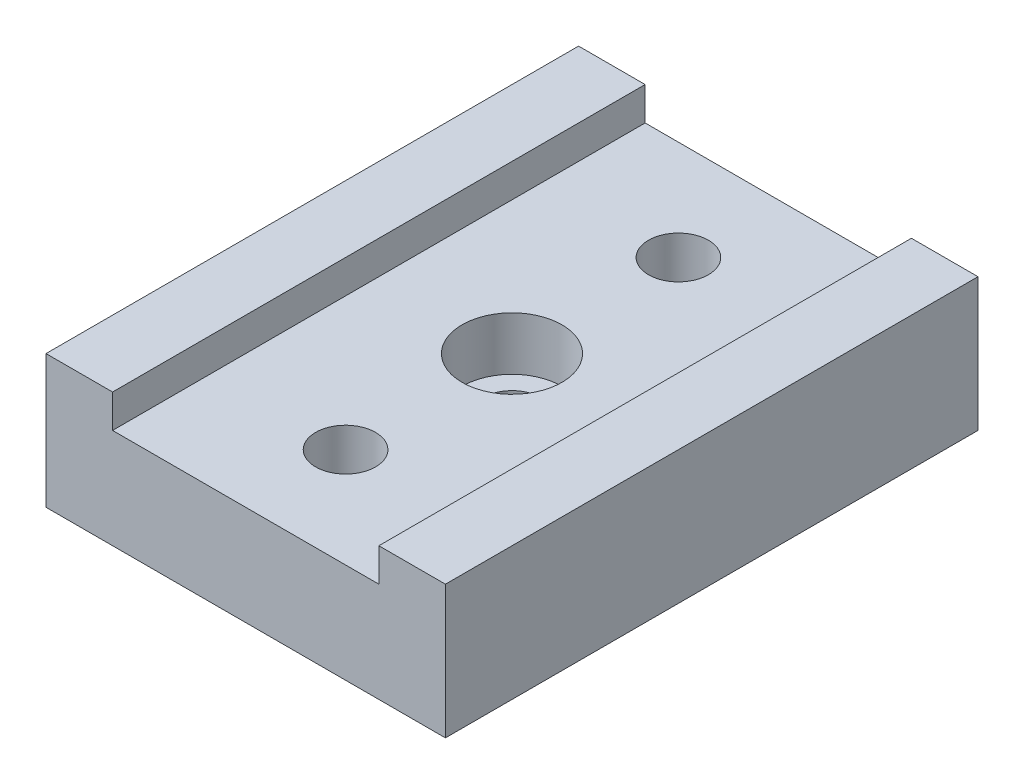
ISO-10303-21;
HEADER;
FILE_DESCRIPTION(('STEP AP214'),'2;1');
FILE_NAME('part.step','',(''),(''),'','','');
FILE_SCHEMA(('AUTOMOTIVE_DESIGN { 1 0 10303 214 1 1 1 1 }'));
ENDSEC;
DATA;
#1=APPLICATION_CONTEXT('core data for automotive mechanical design processes');
#2=APPLICATION_PROTOCOL_DEFINITION('international standard','automotive_design',2000,#1);
#3=PRODUCT_CONTEXT('',#1,'mechanical');
#4=PRODUCT('Part','Part','',(#3));
#5=PRODUCT_RELATED_PRODUCT_CATEGORY('part','',(#4));
#6=PRODUCT_DEFINITION_FORMATION('','',#4);
#7=PRODUCT_DEFINITION_CONTEXT('part definition',#1,'design');
#8=PRODUCT_DEFINITION('design','',#6,#7);
#9=PRODUCT_DEFINITION_SHAPE('','',#8);
#10=(LENGTH_UNIT() NAMED_UNIT(*) SI_UNIT(.MILLI.,.METRE.));
#11=(NAMED_UNIT(*) PLANE_ANGLE_UNIT() SI_UNIT($,.RADIAN.));
#12=(NAMED_UNIT(*) SI_UNIT($,.STERADIAN.) SOLID_ANGLE_UNIT());
#13=UNCERTAINTY_MEASURE_WITH_UNIT(LENGTH_MEASURE(1.E-05),#10,'distance_accuracy_value','');
#14=(GEOMETRIC_REPRESENTATION_CONTEXT(3) GLOBAL_UNCERTAINTY_ASSIGNED_CONTEXT((#13)) GLOBAL_UNIT_ASSIGNED_CONTEXT((#10,
#11,#12)) REPRESENTATION_CONTEXT('',''));
#15=CARTESIAN_POINT('',(0.,0.,0.));
#16=DIRECTION('',(0.,0.,1.));
#17=DIRECTION('',(1.,0.,0.));
#18=AXIS2_PLACEMENT_3D('',#15,#16,#17);
#19=CARTESIAN_POINT('',(30.,15.,40.));
#20=DIRECTION('',(0.,1.,0.));
#21=DIRECTION('',(0.,0.,1.));
#22=AXIS2_PLACEMENT_3D('',#19,#20,#21);
#23=CYLINDRICAL_SURFACE('',#22,4.5);
#24=CARTESIAN_POINT('',(30.,6.99999999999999,40.));
#25=DIRECTION('',(0.,1.,0.));
#26=DIRECTION('',(0.,0.,1.));
#27=AXIS2_PLACEMENT_3D('',#24,#25,#26);
#28=CIRCLE('',#27,4.5);
#29=CARTESIAN_POINT('',(30.,6.99999999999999,44.5));
#30=VERTEX_POINT('',#29);
#31=EDGE_CURVE('E135',#30,#30,#28,.T.);
#32=ORIENTED_EDGE('',*,*,#31,.T.);
#33=EDGE_LOOP('',(#32));
#34=FACE_BOUND('',#33,.T.);
#35=CARTESIAN_POINT('',(30.,2.,40.));
#36=DIRECTION('',(0.,-1.,0.));
#37=DIRECTION('',(1.,0.,0.));
#38=AXIS2_PLACEMENT_3D('',#35,#36,#37);
#39=CIRCLE('',#38,4.5);
#40=CARTESIAN_POINT('',(34.5,2.,40.));
#41=VERTEX_POINT('',#40);
#42=EDGE_CURVE('E158',#41,#41,#39,.F.);
#43=ORIENTED_EDGE('',*,*,#42,.F.);
#44=EDGE_LOOP('',(#43));
#45=FACE_BOUND('',#44,.T.);
#46=ADVANCED_FACE('F32',(#34,#45),#23,.F.);
#47=CARTESIAN_POINT('',(60.,0.,80.));
#48=DIRECTION('',(0.,1.,0.));
#49=DIRECTION('',(-1.,0.,0.));
#50=AXIS2_PLACEMENT_3D('',#47,#48,#49);
#51=PLANE('',#50);
#52=CARTESIAN_POINT('',(30.,0.,15.));
#53=DIRECTION('',(0.,-1.,0.));
#54=DIRECTION('',(0.,0.,-1.));
#55=AXIS2_PLACEMENT_3D('',#52,#53,#54);
#56=CIRCLE('',#55,7.5);
#57=CARTESIAN_POINT('',(30.,0.,7.5));
#58=VERTEX_POINT('',#57);
#59=EDGE_CURVE('E407',#58,#58,#56,.T.);
#60=ORIENTED_EDGE('',*,*,#59,.F.);
#61=EDGE_LOOP('',(#60));
#62=FACE_BOUND('',#61,.T.);
#63=CARTESIAN_POINT('',(30.,0.,65.));
#64=DIRECTION('',(0.,-1.,0.));
#65=DIRECTION('',(0.,0.,-1.));
#66=AXIS2_PLACEMENT_3D('',#63,#64,#65);
#67=CIRCLE('',#66,7.5);
#68=CARTESIAN_POINT('',(30.,0.,57.5));
#69=VERTEX_POINT('',#68);
#70=EDGE_CURVE('E176',#69,#69,#67,.T.);
#71=ORIENTED_EDGE('',*,*,#70,.F.);
#72=EDGE_LOOP('',(#71));
#73=FACE_BOUND('',#72,.T.);
#74=CARTESIAN_POINT('',(30.,0.,40.));
#75=DIRECTION('',(0.,-1.,0.));
#76=DIRECTION('',(1.,0.,0.));
#77=AXIS2_PLACEMENT_3D('',#74,#75,#76);
#78=CIRCLE('',#77,9.99999999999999);
#79=CARTESIAN_POINT('',(40.,0.,40.));
#80=VERTEX_POINT('',#79);
#81=EDGE_CURVE('E164',#80,#80,#78,.T.);
#82=ORIENTED_EDGE('',*,*,#81,.F.);
#83=EDGE_LOOP('',(#82));
#84=FACE_BOUND('',#83,.T.);
#85=DIRECTION('',(1.,0.,0.));
#86=VECTOR('',#85,1.);
#87=CARTESIAN_POINT('',(60.,0.,0.));
#88=LINE('',#87,#86);
#89=CARTESIAN_POINT('',(0.,0.,0.));
#90=VERTEX_POINT('',#89);
#91=CARTESIAN_POINT('',(60.,0.,0.));
#92=VERTEX_POINT('',#91);
#93=EDGE_CURVE('E131',#90,#92,#88,.T.);
#94=ORIENTED_EDGE('',*,*,#93,.T.);
#95=DIRECTION('',(0.,0.,-1.));
#96=VECTOR('',#95,1.);
#97=CARTESIAN_POINT('',(60.,0.,80.));
#98=LINE('',#97,#96);
#99=CARTESIAN_POINT('',(60.,0.,80.));
#100=VERTEX_POINT('',#99);
#101=EDGE_CURVE('E11',#100,#92,#98,.T.);
#102=ORIENTED_EDGE('',*,*,#101,.F.);
#103=DIRECTION('',(1.,0.,0.));
#104=VECTOR('',#103,1.);
#105=CARTESIAN_POINT('',(60.,0.,80.));
#106=LINE('',#105,#104);
#107=CARTESIAN_POINT('',(0.,0.,80.));
#108=VERTEX_POINT('',#107);
#109=EDGE_CURVE('E146',#108,#100,#106,.T.);
#110=ORIENTED_EDGE('',*,*,#109,.F.);
#111=DIRECTION('',(0.,0.,-1.));
#112=VECTOR('',#111,1.);
#113=CARTESIAN_POINT('',(0.,0.,80.));
#114=LINE('',#113,#112);
#115=EDGE_CURVE('E127',#108,#90,#114,.T.);
#116=ORIENTED_EDGE('',*,*,#115,.T.);
#117=EDGE_LOOP('',(#94,#102,#110,#116));
#118=FACE_BOUND('',#117,.T.);
#119=ADVANCED_FACE('F34',(#62,#73,#84,#118),#51,.F.);
#120=CARTESIAN_POINT('',(60.,0.,80.));
#121=DIRECTION('',(-1.,0.,0.));
#122=DIRECTION('',(0.,0.,1.));
#123=AXIS2_PLACEMENT_3D('',#120,#121,#122);
#124=PLANE('',#123);
#125=DIRECTION('',(0.,1.,0.));
#126=VECTOR('',#125,1.);
#127=CARTESIAN_POINT('',(60.,0.,0.));
#128=LINE('',#127,#126);
#129=CARTESIAN_POINT('',(60.,20.,0.));
#130=VERTEX_POINT('',#129);
#131=EDGE_CURVE('E134',#92,#130,#128,.T.);
#132=ORIENTED_EDGE('',*,*,#131,.T.);
#133=DIRECTION('',(0.,0.,-1.));
#134=VECTOR('',#133,1.);
#135=CARTESIAN_POINT('',(60.,20.,80.));
#136=LINE('',#135,#134);
#137=CARTESIAN_POINT('',(60.,20.,80.));
#138=VERTEX_POINT('',#137);
#139=EDGE_CURVE('E42',#138,#130,#136,.T.);
#140=ORIENTED_EDGE('',*,*,#139,.F.);
#141=DIRECTION('',(0.,1.,0.));
#142=VECTOR('',#141,1.);
#143=CARTESIAN_POINT('',(60.,0.,80.));
#144=LINE('',#143,#142);
#145=EDGE_CURVE('E94',#100,#138,#144,.T.);
#146=ORIENTED_EDGE('',*,*,#145,.F.);
#147=ORIENTED_EDGE('',*,*,#101,.T.);
#148=EDGE_LOOP('',(#132,#140,#146,#147));
#149=FACE_BOUND('',#148,.T.);
#150=ADVANCED_FACE('F228',(#149),#124,.F.);
#151=CARTESIAN_POINT('',(50.,20.,80.));
#152=DIRECTION('',(0.,-1.,0.));
#153=DIRECTION('',(0.,0.,-1.));
#154=AXIS2_PLACEMENT_3D('',#151,#152,#153);
#155=PLANE('',#154);
#156=DIRECTION('',(-1.,0.,0.));
#157=VECTOR('',#156,1.);
#158=CARTESIAN_POINT('',(50.,20.,0.));
#159=LINE('',#158,#157);
#160=CARTESIAN_POINT('',(50.,20.,0.));
#161=VERTEX_POINT('',#160);
#162=EDGE_CURVE('E137',#130,#161,#159,.T.);
#163=ORIENTED_EDGE('',*,*,#162,.T.);
#164=DIRECTION('',(0.,0.,-1.));
#165=VECTOR('',#164,1.);
#166=CARTESIAN_POINT('',(50.,20.,80.));
#167=LINE('',#166,#165);
#168=CARTESIAN_POINT('',(50.,20.,80.));
#169=VERTEX_POINT('',#168);
#170=EDGE_CURVE('E153',#169,#161,#167,.T.);
#171=ORIENTED_EDGE('',*,*,#170,.F.);
#172=DIRECTION('',(-1.,0.,0.));
#173=VECTOR('',#172,1.);
#174=CARTESIAN_POINT('',(50.,20.,80.));
#175=LINE('',#174,#173);
#176=EDGE_CURVE('E191',#138,#169,#175,.T.);
#177=ORIENTED_EDGE('',*,*,#176,.F.);
#178=ORIENTED_EDGE('',*,*,#139,.T.);
#179=EDGE_LOOP('',(#163,#171,#177,#178));
#180=FACE_BOUND('',#179,.T.);
#181=ADVANCED_FACE('F260',(#180),#155,.F.);
#182=CARTESIAN_POINT('',(50.,15.,80.));
#183=DIRECTION('',(1.,0.,0.));
#184=DIRECTION('',(0.,0.,-1.));
#185=AXIS2_PLACEMENT_3D('',#182,#183,#184);
#186=PLANE('',#185);
#187=DIRECTION('',(0.,-1.,0.));
#188=VECTOR('',#187,1.);
#189=CARTESIAN_POINT('',(50.,15.,0.));
#190=LINE('',#189,#188);
#191=CARTESIAN_POINT('',(50.,15.,0.));
#192=VERTEX_POINT('',#191);
#193=EDGE_CURVE('E139',#161,#192,#190,.T.);
#194=ORIENTED_EDGE('',*,*,#193,.T.);
#195=DIRECTION('',(0.,0.,-1.));
#196=VECTOR('',#195,1.);
#197=CARTESIAN_POINT('',(50.,15.,80.));
#198=LINE('',#197,#196);
#199=CARTESIAN_POINT('',(50.,15.,80.));
#200=VERTEX_POINT('',#199);
#201=EDGE_CURVE('E150',#200,#192,#198,.T.);
#202=ORIENTED_EDGE('',*,*,#201,.F.);
#203=DIRECTION('',(0.,-1.,0.));
#204=VECTOR('',#203,1.);
#205=CARTESIAN_POINT('',(50.,15.,80.));
#206=LINE('',#205,#204);
#207=EDGE_CURVE('E193',#169,#200,#206,.T.);
#208=ORIENTED_EDGE('',*,*,#207,.F.);
#209=ORIENTED_EDGE('',*,*,#170,.T.);
#210=EDGE_LOOP('',(#194,#202,#208,#209));
#211=FACE_BOUND('',#210,.T.);
#212=ADVANCED_FACE('F199',(#211),#186,.F.);
#213=CARTESIAN_POINT('',(10.,15.,80.));
#214=DIRECTION('',(0.,-1.,0.));
#215=DIRECTION('',(0.,0.,-1.));
#216=AXIS2_PLACEMENT_3D('',#213,#214,#215);
#217=PLANE('',#216);
#218=CARTESIAN_POINT('',(30.,15.,15.));
#219=DIRECTION('',(0.,-1.,0.));
#220=DIRECTION('',(0.,0.,-1.));
#221=AXIS2_PLACEMENT_3D('',#218,#219,#220);
#222=CIRCLE('',#221,4.5);
#223=CARTESIAN_POINT('',(30.,15.,10.5));
#224=VERTEX_POINT('',#223);
#225=EDGE_CURVE('E36',#224,#224,#222,.T.);
#226=ORIENTED_EDGE('',*,*,#225,.T.);
#227=EDGE_LOOP('',(#226));
#228=FACE_BOUND('',#227,.T.);
#229=CARTESIAN_POINT('',(30.,15.,65.));
#230=DIRECTION('',(0.,-1.,0.));
#231=DIRECTION('',(0.,0.,-1.));
#232=AXIS2_PLACEMENT_3D('',#229,#230,#231);
#233=CIRCLE('',#232,4.5);
#234=CARTESIAN_POINT('',(30.,15.,60.5));
#235=VERTEX_POINT('',#234);
#236=EDGE_CURVE('E162',#235,#235,#233,.T.);
#237=ORIENTED_EDGE('',*,*,#236,.T.);
#238=EDGE_LOOP('',(#237));
#239=FACE_BOUND('',#238,.T.);
#240=CARTESIAN_POINT('',(30.,15.,40.));
#241=DIRECTION('',(0.,1.,0.));
#242=DIRECTION('',(0.,0.,1.));
#243=AXIS2_PLACEMENT_3D('',#240,#241,#242);
#244=CIRCLE('',#243,7.5);
#245=CARTESIAN_POINT('',(30.,15.,47.5));
#246=VERTEX_POINT('',#245);
#247=EDGE_CURVE('E160',#246,#246,#244,.T.);
#248=ORIENTED_EDGE('',*,*,#247,.F.);
#249=EDGE_LOOP('',(#248));
#250=FACE_BOUND('',#249,.T.);
#251=DIRECTION('',(-1.,0.,0.));
#252=VECTOR('',#251,1.);
#253=CARTESIAN_POINT('',(10.,15.,0.));
#254=LINE('',#253,#252);
#255=CARTESIAN_POINT('',(10.,15.,0.));
#256=VERTEX_POINT('',#255);
#257=EDGE_CURVE('E141',#192,#256,#254,.T.);
#258=ORIENTED_EDGE('',*,*,#257,.T.);
#259=DIRECTION('',(0.,0.,-1.));
#260=VECTOR('',#259,1.);
#261=CARTESIAN_POINT('',(10.,15.,80.));
#262=LINE('',#261,#260);
#263=CARTESIAN_POINT('',(10.,15.,80.));
#264=VERTEX_POINT('',#263);
#265=EDGE_CURVE('E122',#264,#256,#262,.T.);
#266=ORIENTED_EDGE('',*,*,#265,.F.);
#267=DIRECTION('',(-1.,0.,0.));
#268=VECTOR('',#267,1.);
#269=CARTESIAN_POINT('',(10.,15.,80.));
#270=LINE('',#269,#268);
#271=EDGE_CURVE('E113',#200,#264,#270,.T.);
#272=ORIENTED_EDGE('',*,*,#271,.F.);
#273=ORIENTED_EDGE('',*,*,#201,.T.);
#274=EDGE_LOOP('',(#258,#266,#272,#273));
#275=FACE_BOUND('',#274,.T.);
#276=ADVANCED_FACE('F203',(#228,#239,#250,#275),#217,.F.);
#277=CARTESIAN_POINT('',(10.,20.,80.));
#278=DIRECTION('',(-1.,0.,0.));
#279=DIRECTION('',(0.,-1.,0.));
#280=AXIS2_PLACEMENT_3D('',#277,#278,#279);
#281=PLANE('',#280);
#282=DIRECTION('',(0.,1.,0.));
#283=VECTOR('',#282,1.);
#284=CARTESIAN_POINT('',(10.,20.,0.));
#285=LINE('',#284,#283);
#286=CARTESIAN_POINT('',(10.,20.,0.));
#287=VERTEX_POINT('',#286);
#288=EDGE_CURVE('E121',#256,#287,#285,.T.);
#289=ORIENTED_EDGE('',*,*,#288,.T.);
#290=DIRECTION('',(0.,0.,-1.));
#291=VECTOR('',#290,1.);
#292=CARTESIAN_POINT('',(10.,20.,80.));
#293=LINE('',#292,#291);
#294=CARTESIAN_POINT('',(10.,20.,80.));
#295=VERTEX_POINT('',#294);
#296=EDGE_CURVE('E118',#295,#287,#293,.T.);
#297=ORIENTED_EDGE('',*,*,#296,.F.);
#298=DIRECTION('',(0.,1.,0.));
#299=VECTOR('',#298,1.);
#300=CARTESIAN_POINT('',(10.,20.,80.));
#301=LINE('',#300,#299);
#302=EDGE_CURVE('E107',#264,#295,#301,.T.);
#303=ORIENTED_EDGE('',*,*,#302,.F.);
#304=ORIENTED_EDGE('',*,*,#265,.T.);
#305=EDGE_LOOP('',(#289,#297,#303,#304));
#306=FACE_BOUND('',#305,.T.);
#307=ADVANCED_FACE('F119',(#306),#281,.F.);
#308=CARTESIAN_POINT('',(0.,20.,80.));
#309=DIRECTION('',(0.,-1.,0.));
#310=DIRECTION('',(0.,0.,-1.));
#311=AXIS2_PLACEMENT_3D('',#308,#309,#310);
#312=PLANE('',#311);
#313=DIRECTION('',(-1.,0.,0.));
#314=VECTOR('',#313,1.);
#315=CARTESIAN_POINT('',(0.,20.,0.));
#316=LINE('',#315,#314);
#317=CARTESIAN_POINT('',(0.,20.,0.));
#318=VERTEX_POINT('',#317);
#319=EDGE_CURVE('E80',#287,#318,#316,.T.);
#320=ORIENTED_EDGE('',*,*,#319,.T.);
#321=DIRECTION('',(0.,0.,-1.));
#322=VECTOR('',#321,1.);
#323=CARTESIAN_POINT('',(0.,20.,80.));
#324=LINE('',#323,#322);
#325=CARTESIAN_POINT('',(0.,20.,80.));
#326=VERTEX_POINT('',#325);
#327=EDGE_CURVE('E123',#326,#318,#324,.T.);
#328=ORIENTED_EDGE('',*,*,#327,.F.);
#329=DIRECTION('',(-1.,0.,0.));
#330=VECTOR('',#329,1.);
#331=CARTESIAN_POINT('',(0.,20.,80.));
#332=LINE('',#331,#330);
#333=EDGE_CURVE('E111',#295,#326,#332,.T.);
#334=ORIENTED_EDGE('',*,*,#333,.F.);
#335=ORIENTED_EDGE('',*,*,#296,.T.);
#336=EDGE_LOOP('',(#320,#328,#334,#335));
#337=FACE_BOUND('',#336,.T.);
#338=ADVANCED_FACE('F125',(#337),#312,.F.);
#339=CARTESIAN_POINT('',(0.,0.,80.));
#340=DIRECTION('',(1.,0.,0.));
#341=DIRECTION('',(0.,0.,-1.));
#342=AXIS2_PLACEMENT_3D('',#339,#340,#341);
#343=PLANE('',#342);
#344=DIRECTION('',(0.,-1.,0.));
#345=VECTOR('',#344,1.);
#346=CARTESIAN_POINT('',(0.,0.,0.));
#347=LINE('',#346,#345);
#348=EDGE_CURVE('E86',#318,#90,#347,.T.);
#349=ORIENTED_EDGE('',*,*,#348,.T.);
#350=ORIENTED_EDGE('',*,*,#115,.F.);
#351=DIRECTION('',(0.,-1.,0.));
#352=VECTOR('',#351,1.);
#353=CARTESIAN_POINT('',(0.,0.,80.));
#354=LINE('',#353,#352);
#355=EDGE_CURVE('E51',#326,#108,#354,.T.);
#356=ORIENTED_EDGE('',*,*,#355,.F.);
#357=ORIENTED_EDGE('',*,*,#327,.T.);
#358=EDGE_LOOP('',(#349,#350,#356,#357));
#359=FACE_BOUND('',#358,.T.);
#360=ADVANCED_FACE('F211',(#359),#343,.F.);
#361=CARTESIAN_POINT('',(0.,0.,80.));
#362=DIRECTION('',(0.,0.,-1.));
#363=DIRECTION('',(-1.,0.,0.));
#364=AXIS2_PLACEMENT_3D('',#361,#362,#363);
#365=PLANE('',#364);
#366=ORIENTED_EDGE('',*,*,#109,.T.);
#367=ORIENTED_EDGE('',*,*,#145,.T.);
#368=ORIENTED_EDGE('',*,*,#176,.T.);
#369=ORIENTED_EDGE('',*,*,#207,.T.);
#370=ORIENTED_EDGE('',*,*,#271,.T.);
#371=ORIENTED_EDGE('',*,*,#302,.T.);
#372=ORIENTED_EDGE('',*,*,#333,.T.);
#373=ORIENTED_EDGE('',*,*,#355,.T.);
#374=EDGE_LOOP('',(#366,#367,#368,#369,#370,#371,#372,#373));
#375=FACE_BOUND('',#374,.T.);
#376=ADVANCED_FACE('F109',(#375),#365,.F.);
#377=CARTESIAN_POINT('',(0.,0.,0.));
#378=DIRECTION('',(0.,0.,-1.));
#379=DIRECTION('',(-1.,0.,0.));
#380=AXIS2_PLACEMENT_3D('',#377,#378,#379);
#381=PLANE('',#380);
#382=ORIENTED_EDGE('',*,*,#93,.F.);
#383=ORIENTED_EDGE('',*,*,#348,.F.);
#384=ORIENTED_EDGE('',*,*,#319,.F.);
#385=ORIENTED_EDGE('',*,*,#288,.F.);
#386=ORIENTED_EDGE('',*,*,#257,.F.);
#387=ORIENTED_EDGE('',*,*,#193,.F.);
#388=ORIENTED_EDGE('',*,*,#162,.F.);
#389=ORIENTED_EDGE('',*,*,#131,.F.);
#390=EDGE_LOOP('',(#382,#383,#384,#385,#386,#387,#388,#389));
#391=FACE_BOUND('',#390,.T.);
#392=ADVANCED_FACE('F206',(#391),#381,.T.);
#393=CARTESIAN_POINT('',(34.5,6.99999999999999,40.));
#394=DIRECTION('',(0.,-1.,0.));
#395=DIRECTION('',(0.,0.,-1.));
#396=AXIS2_PLACEMENT_3D('',#393,#394,#395);
#397=PLANE('',#396);
#398=ORIENTED_EDGE('',*,*,#31,.F.);
#399=EDGE_LOOP('',(#398));
#400=FACE_BOUND('',#399,.T.);
#401=CARTESIAN_POINT('',(30.,6.99999999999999,40.));
#402=DIRECTION('',(0.,1.,0.));
#403=DIRECTION('',(0.,0.,1.));
#404=AXIS2_PLACEMENT_3D('',#401,#402,#403);
#405=CIRCLE('',#404,7.5);
#406=CARTESIAN_POINT('',(30.,6.99999999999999,47.5));
#407=VERTEX_POINT('',#406);
#408=EDGE_CURVE('E184',#407,#407,#405,.T.);
#409=ORIENTED_EDGE('',*,*,#408,.T.);
#410=EDGE_LOOP('',(#409));
#411=FACE_BOUND('',#410,.T.);
#412=ADVANCED_FACE('F232',(#400,#411),#397,.F.);
#413=CARTESIAN_POINT('',(30.,15.,40.));
#414=DIRECTION('',(0.,1.,0.));
#415=DIRECTION('',(0.,0.,1.));
#416=AXIS2_PLACEMENT_3D('',#413,#414,#415);
#417=CYLINDRICAL_SURFACE('',#416,7.5);
#418=ORIENTED_EDGE('',*,*,#408,.F.);
#419=EDGE_LOOP('',(#418));
#420=FACE_BOUND('',#419,.T.);
#421=ORIENTED_EDGE('',*,*,#247,.T.);
#422=EDGE_LOOP('',(#421));
#423=FACE_BOUND('',#422,.T.);
#424=ADVANCED_FACE('F238',(#420,#423),#417,.F.);
#425=CARTESIAN_POINT('',(30.,2.,40.));
#426=DIRECTION('',(0.,-1.,0.));
#427=DIRECTION('',(1.,0.,0.));
#428=AXIS2_PLACEMENT_3D('',#425,#426,#427);
#429=PLANE('',#428);
#430=CARTESIAN_POINT('',(30.,2.,40.));
#431=DIRECTION('',(0.,-1.,0.));
#432=DIRECTION('',(1.,0.,0.));
#433=AXIS2_PLACEMENT_3D('',#430,#431,#432);
#434=CIRCLE('',#433,9.99999999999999);
#435=CARTESIAN_POINT('',(40.,2.,40.));
#436=VERTEX_POINT('',#435);
#437=EDGE_CURVE('E161',#436,#436,#434,.T.);
#438=ORIENTED_EDGE('',*,*,#437,.T.);
#439=EDGE_LOOP('',(#438));
#440=FACE_BOUND('',#439,.T.);
#441=ORIENTED_EDGE('',*,*,#42,.T.);
#442=EDGE_LOOP('',(#441));
#443=FACE_BOUND('',#442,.T.);
#444=ADVANCED_FACE('F243',(#440,#443),#429,.T.);
#445=CARTESIAN_POINT('',(30.,2.,40.));
#446=DIRECTION('',(0.,-1.,0.));
#447=DIRECTION('',(1.,0.,0.));
#448=AXIS2_PLACEMENT_3D('',#445,#446,#447);
#449=CYLINDRICAL_SURFACE('',#448,9.99999999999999);
#450=ORIENTED_EDGE('',*,*,#437,.F.);
#451=EDGE_LOOP('',(#450));
#452=FACE_BOUND('',#451,.T.);
#453=ORIENTED_EDGE('',*,*,#81,.T.);
#454=EDGE_LOOP('',(#453));
#455=FACE_BOUND('',#454,.T.);
#456=ADVANCED_FACE('F328',(#452,#455),#449,.F.);
#457=CARTESIAN_POINT('',(30.,0.,65.));
#458=DIRECTION('',(0.,-1.,0.));
#459=DIRECTION('',(0.,0.,-1.));
#460=AXIS2_PLACEMENT_3D('',#457,#458,#459);
#461=CYLINDRICAL_SURFACE('',#460,4.5);
#462=CARTESIAN_POINT('',(30.,8.,65.));
#463=DIRECTION('',(0.,-1.,0.));
#464=DIRECTION('',(0.,0.,-1.));
#465=AXIS2_PLACEMENT_3D('',#462,#463,#464);
#466=CIRCLE('',#465,4.5);
#467=CARTESIAN_POINT('',(30.,8.,60.5));
#468=VERTEX_POINT('',#467);
#469=EDGE_CURVE('E165',#468,#468,#466,.T.);
#470=ORIENTED_EDGE('',*,*,#469,.T.);
#471=EDGE_LOOP('',(#470));
#472=FACE_BOUND('',#471,.T.);
#473=ORIENTED_EDGE('',*,*,#236,.F.);
#474=EDGE_LOOP('',(#473));
#475=FACE_BOUND('',#474,.T.);
#476=ADVANCED_FACE('F337',(#472,#475),#461,.F.);
#477=CARTESIAN_POINT('',(34.5,8.,65.));
#478=DIRECTION('',(0.,1.,0.));
#479=DIRECTION('',(0.,0.,1.));
#480=AXIS2_PLACEMENT_3D('',#477,#478,#479);
#481=PLANE('',#480);
#482=ORIENTED_EDGE('',*,*,#469,.F.);
#483=EDGE_LOOP('',(#482));
#484=FACE_BOUND('',#483,.T.);
#485=CARTESIAN_POINT('',(30.,8.,65.));
#486=DIRECTION('',(0.,-1.,0.));
#487=DIRECTION('',(0.,0.,-1.));
#488=AXIS2_PLACEMENT_3D('',#485,#486,#487);
#489=CIRCLE('',#488,7.5);
#490=CARTESIAN_POINT('',(30.,8.,57.5));
#491=VERTEX_POINT('',#490);
#492=EDGE_CURVE('E171',#491,#491,#489,.T.);
#493=ORIENTED_EDGE('',*,*,#492,.T.);
#494=EDGE_LOOP('',(#493));
#495=FACE_BOUND('',#494,.T.);
#496=ADVANCED_FACE('F348',(#484,#495),#481,.F.);
#497=CARTESIAN_POINT('',(30.,0.,65.));
#498=DIRECTION('',(0.,-1.,0.));
#499=DIRECTION('',(0.,0.,-1.));
#500=AXIS2_PLACEMENT_3D('',#497,#498,#499);
#501=CYLINDRICAL_SURFACE('',#500,7.5);
#502=ORIENTED_EDGE('',*,*,#492,.F.);
#503=EDGE_LOOP('',(#502));
#504=FACE_BOUND('',#503,.T.);
#505=ORIENTED_EDGE('',*,*,#70,.T.);
#506=EDGE_LOOP('',(#505));
#507=FACE_BOUND('',#506,.T.);
#508=ADVANCED_FACE('F354',(#504,#507),#501,.F.);
#509=CARTESIAN_POINT('',(30.,0.,15.));
#510=DIRECTION('',(0.,-1.,0.));
#511=DIRECTION('',(0.,0.,-1.));
#512=AXIS2_PLACEMENT_3D('',#509,#510,#511);
#513=CYLINDRICAL_SURFACE('',#512,4.5);
#514=CARTESIAN_POINT('',(30.,8.,15.));
#515=DIRECTION('',(0.,-1.,0.));
#516=DIRECTION('',(0.,0.,-1.));
#517=AXIS2_PLACEMENT_3D('',#514,#515,#516);
#518=CIRCLE('',#517,4.5);
#519=CARTESIAN_POINT('',(30.,8.,10.5));
#520=VERTEX_POINT('',#519);
#521=EDGE_CURVE('E409',#520,#520,#518,.T.);
#522=ORIENTED_EDGE('',*,*,#521,.T.);
#523=EDGE_LOOP('',(#522));
#524=FACE_BOUND('',#523,.T.);
#525=ORIENTED_EDGE('',*,*,#225,.F.);
#526=EDGE_LOOP('',(#525));
#527=FACE_BOUND('',#526,.T.);
#528=ADVANCED_FACE('F362',(#524,#527),#513,.F.);
#529=CARTESIAN_POINT('',(34.5,8.,15.));
#530=DIRECTION('',(0.,1.,0.));
#531=DIRECTION('',(0.,0.,1.));
#532=AXIS2_PLACEMENT_3D('',#529,#530,#531);
#533=PLANE('',#532);
#534=ORIENTED_EDGE('',*,*,#521,.F.);
#535=EDGE_LOOP('',(#534));
#536=FACE_BOUND('',#535,.T.);
#537=CARTESIAN_POINT('',(30.,8.,15.));
#538=DIRECTION('',(0.,-1.,0.));
#539=DIRECTION('',(0.,0.,-1.));
#540=AXIS2_PLACEMENT_3D('',#537,#538,#539);
#541=CIRCLE('',#540,7.5);
#542=CARTESIAN_POINT('',(30.,8.,7.5));
#543=VERTEX_POINT('',#542);
#544=EDGE_CURVE('E404',#543,#543,#541,.T.);
#545=ORIENTED_EDGE('',*,*,#544,.T.);
#546=EDGE_LOOP('',(#545));
#547=FACE_BOUND('',#546,.T.);
#548=ADVANCED_FACE('F370',(#536,#547),#533,.F.);
#549=CARTESIAN_POINT('',(30.,0.,15.));
#550=DIRECTION('',(0.,-1.,0.));
#551=DIRECTION('',(0.,0.,-1.));
#552=AXIS2_PLACEMENT_3D('',#549,#550,#551);
#553=CYLINDRICAL_SURFACE('',#552,7.5);
#554=ORIENTED_EDGE('',*,*,#544,.F.);
#555=EDGE_LOOP('',(#554));
#556=FACE_BOUND('',#555,.T.);
#557=ORIENTED_EDGE('',*,*,#59,.T.);
#558=EDGE_LOOP('',(#557));
#559=FACE_BOUND('',#558,.T.);
#560=ADVANCED_FACE('F378',(#556,#559),#553,.F.);
#561=CLOSED_SHELL('',(#46,#119,#150,#181,#212,#276,#307,#338,#360,#376,#392,#412,#424,#444,#456,
#476,#496,#508,#528,#548,#560));
#562=MANIFOLD_SOLID_BREP('B2',#561);
#563=ADVANCED_BREP_SHAPE_REPRESENTATION('',(#18,#562),#14);
#564=SHAPE_DEFINITION_REPRESENTATION(#9,#563);
ENDSEC;
END-ISO-10303-21;
